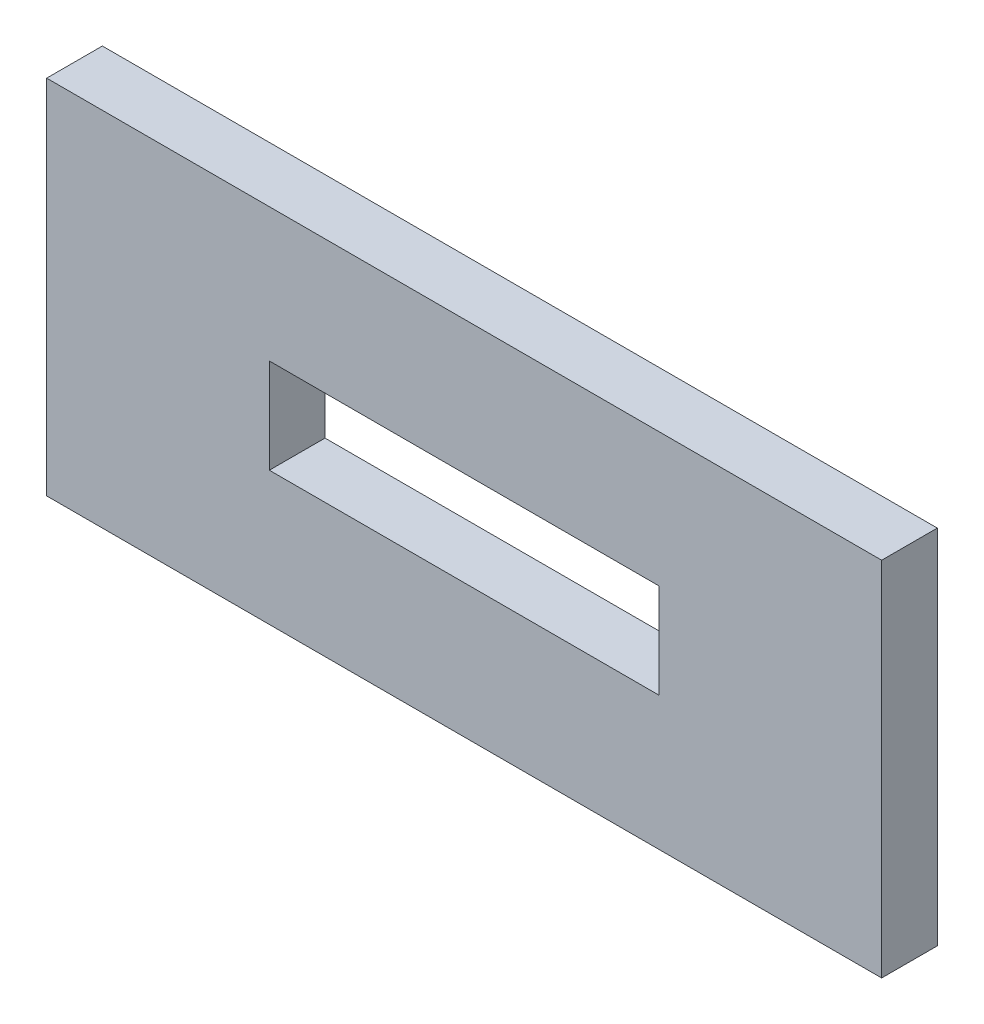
from build123d import *

# Parameters (mm, degrees)
SKIZZE1_W                       = 300
SKIZZE1_H                       = 20
AUFSATZ_LINEAR_AUSTRAGEN1_DEPTH = 130
SKIZZE2_W                       = 140
SKIZZE2_H                       = 34
SCHNITT_LINEAR_AUSTRAGEN1_DEPTH = 20


with BuildPart() as part:
    # Skizze1 → Aufsatz-Linear austragen1 (new body)
    with BuildSketch(Plane(origin=(0, 0, 0), x_dir=(1, 0, 0), z_dir=(0, 1, 0))):
        with Locations((-150, -10)):
            Rectangle(SKIZZE1_W, SKIZZE1_H)
    extrude(amount=AUFSATZ_LINEAR_AUSTRAGEN1_DEPTH)

    # Skizze2 → Schnitt-Linear austragen1 (cut)
    with BuildSketch(Plane.XY.offset(20)):
        with Locations((-150, 65)):
            Rectangle(SKIZZE2_W, SKIZZE2_H)
    extrude(amount=-SCHNITT_LINEAR_AUSTRAGEN1_DEPTH, mode=Mode.SUBTRACT)


solid = part.part
